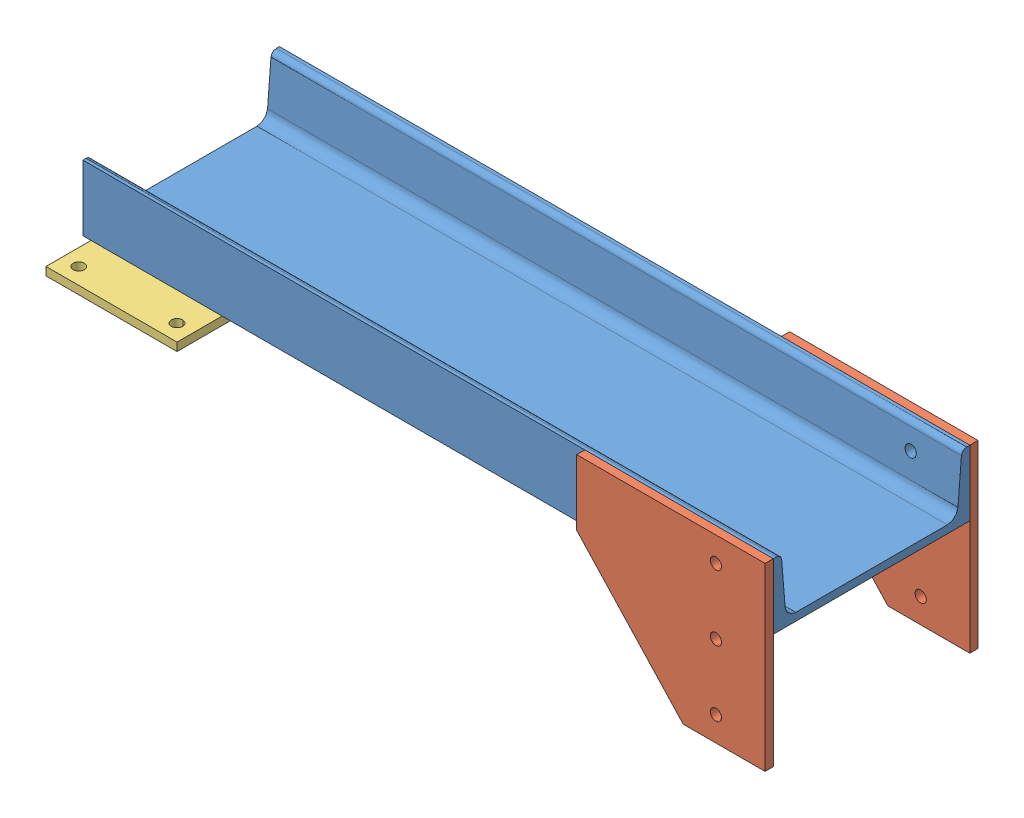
SolidWorks assembly MONTANT EPARPILLEUR.SLDASM, configuration Défaut (file format 3800). Lengths in mm.
Overall size (843 220 350).
4 component instances, 3 part files, 9 mates.
Components (placement in the parent):
- Profilé UPN 240-1: Profilé UPN 240.SLDPRT [Défaut] at (-464.204 -48.382 0) size (843 80 240)
- Tole ep 10  230 x 220-1: Tole ep 10  230 x 220.SLDPRT [Défaut] at (263.796 -78.382 130) x (0 1 0) z (0 0 -1) size (220 230 10)
- Tole ep 10  350 x 230-1: Tole ep 10  350 x 230.SLDPRT [Défaut] at (-409.204 -48.382 0) x (0 0 1) z (0 -1 0) size (350 160 10)
- Tole ep 10  230 x 220-3: Tole ep 10  230 x 220.SLDPRT [Défaut] at (263.796 -78.382 -120) x (0 1 0) z (0 0 -1) size (220 230 10)
Mates (geometry in assembly coordinates):
- Coïncidente1: coincident anti-aligned: plane of Profilé UPN 240-1 through (378.796 -48.382 120) normal (0 -1 0); plane of Tole ep 10  350 x 230-1 through (-454.204 -48.382 -175) normal (0 1 0)
- Distance1: distance = 10 mm aligned: plane of Profilé UPN 240-1 through (-464.204 25.118 -116.1984) normal (-1 0 0); plane of Tole ep 10  350 x 230-1 through (-454.204 -58.382 -175) normal (-1 0 0)
- Distance2: distance = 55 mm aligned: plane of Profilé UPN 240-1 through (378.796 -48.382 -120) normal (0 0 -1); plane of Tole ep 10  350 x 230-1 through (-454.204 -58.382 -175) normal (0 0 -1)
- Coïncidente4: coincident anti-aligned: plane of Profilé UPN 240-1 through (378.796 -48.382 120) normal (0 0 1); plane of Tole ep 10  230 x 220-1 through (378.796 -188.382 120) normal (0 0 -1)
- Coïncidente6: coincident aligned: plane of Profilé UPN 240-1 through (378.796 25.118 -116.1984) normal (1 0 0); plane of Tole ep 10  230 x 220-1 through (378.796 -188.382 120) normal (1 0 0)
- Coïncidente7: coincident anti-aligned: plane of Profilé UPN 240-1 through (378.796 -48.382 -120) normal (0 0 -1); plane of Tole ep 10  230 x 220-3 through (378.796 -188.382 -120) normal (0 0 1)
- Coïncidente8: coincident aligned: plane of Profilé UPN 240-1 through (378.796 25.118 -116.1984) normal (1 0 0); plane of Tole ep 10  230 x 220-3 through (378.796 -188.382 -130) normal (1 0 0)
- Coïncidente9: coincident aligned: plane of Profilé UPN 240-1 through (378.796 31.618 -120) normal (0 1 0); plane of Tole ep 10  230 x 220-3 through (378.796 31.618 -130) normal (0 1 0)
- Coïncidente10: coincident aligned: plane of Profilé UPN 240-1 through (378.796 31.618 120) normal (0 1 0); plane of Tole ep 10  230 x 220-1 through (378.796 31.618 120) normal (0 1 0)
